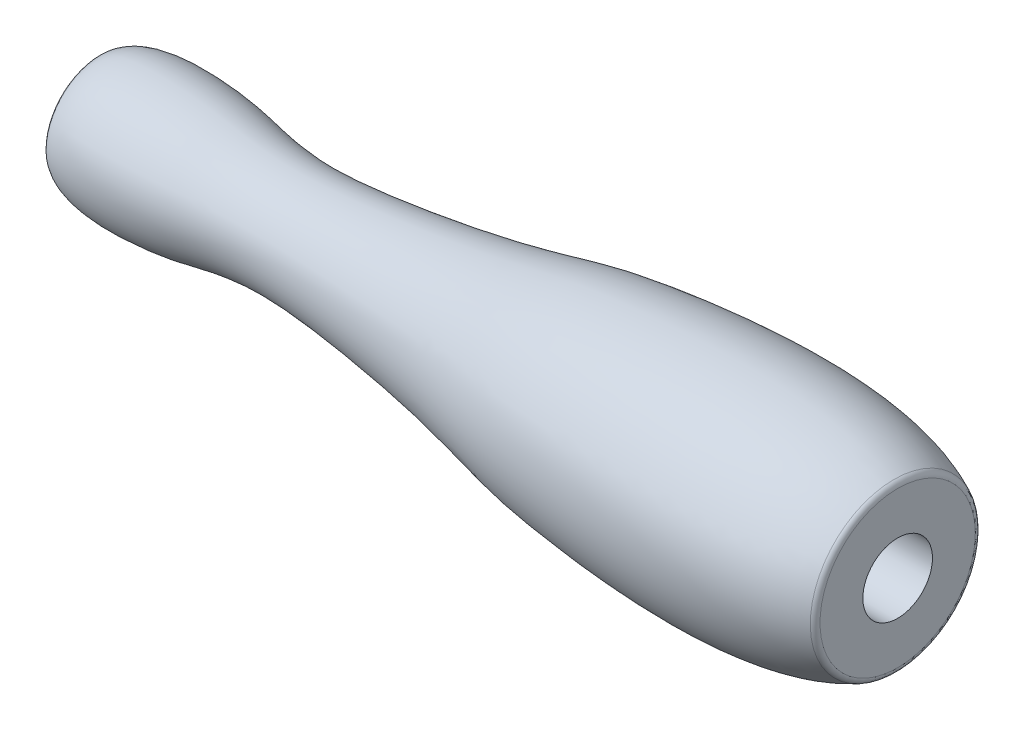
ISO-10303-21;
HEADER;
FILE_DESCRIPTION(('STEP AP214'),'2;1');
FILE_NAME('part.step','',(''),(''),'','','');
FILE_SCHEMA(('AUTOMOTIVE_DESIGN { 1 0 10303 214 1 1 1 1 }'));
ENDSEC;
DATA;
#1=APPLICATION_CONTEXT('core data for automotive mechanical design processes');
#2=APPLICATION_PROTOCOL_DEFINITION('international standard','automotive_design',2000,#1);
#3=PRODUCT_CONTEXT('',#1,'mechanical');
#4=PRODUCT('Part','Part','',(#3));
#5=PRODUCT_RELATED_PRODUCT_CATEGORY('part','',(#4));
#6=PRODUCT_DEFINITION_FORMATION('','',#4);
#7=PRODUCT_DEFINITION_CONTEXT('part definition',#1,'design');
#8=PRODUCT_DEFINITION('design','',#6,#7);
#9=PRODUCT_DEFINITION_SHAPE('','',#8);
#10=(LENGTH_UNIT() NAMED_UNIT(*) SI_UNIT(.MILLI.,.METRE.));
#11=(NAMED_UNIT(*) PLANE_ANGLE_UNIT() SI_UNIT($,.RADIAN.));
#12=(NAMED_UNIT(*) SI_UNIT($,.STERADIAN.) SOLID_ANGLE_UNIT());
#13=UNCERTAINTY_MEASURE_WITH_UNIT(LENGTH_MEASURE(1.E-05),#10,'distance_accuracy_value','');
#14=(GEOMETRIC_REPRESENTATION_CONTEXT(3) GLOBAL_UNCERTAINTY_ASSIGNED_CONTEXT((#13)) GLOBAL_UNIT_ASSIGNED_CONTEXT((#10,
#11,#12)) REPRESENTATION_CONTEXT('',''));
#15=CARTESIAN_POINT('',(0.,0.,0.));
#16=DIRECTION('',(0.,0.,1.));
#17=DIRECTION('',(1.,0.,0.));
#18=AXIS2_PLACEMENT_3D('',#15,#16,#17);
#19=CARTESIAN_POINT('',(0.,9.,0.));
#20=CARTESIAN_POINT('',(-6.95725517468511,16.2468035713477,0.));
#21=CARTESIAN_POINT('',(-24.9652155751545,17.8065846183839,0.));
#22=CARTESIAN_POINT('',(-55.7244856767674,13.9990260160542,0.));
#23=CARTESIAN_POINT('',(-66.583919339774,10.8381797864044,0.));
#24=CARTESIAN_POINT('',(-92.5066939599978,7.28758896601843,0.));
#25=CARTESIAN_POINT('',(-99.5023429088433,7.68432305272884,0.));
#26=CARTESIAN_POINT('',(-110.815290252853,9.98749412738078,0.));
#27=CARTESIAN_POINT('',(-122.149725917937,10.7106934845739,0.));
#28=CARTESIAN_POINT('',(-125.,7.99999999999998,0.));
#29=B_SPLINE_CURVE_WITH_KNOTS('',3,(#19,#20,#21,#22,#23,#24,#25,#26,#27,#28),.UNSPECIFIED.,.F.,
.F.,(4,1,1,1,1,1,1,4),(0.,0.461482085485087,0.525037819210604,0.635557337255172,
0.728128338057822,0.877474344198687,0.899865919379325,1.),.UNSPECIFIED.);
#30=CARTESIAN_POINT('',(0.,0.,0.));
#31=DIRECTION('',(1.,0.,0.));
#32=AXIS1_PLACEMENT('',#30,#31);
#33=SURFACE_OF_REVOLUTION('',#29,#32);
#34=CARTESIAN_POINT('',(-124.579747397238,0.,0.));
#35=DIRECTION('',(1.,0.,0.));
#36=DIRECTION('',(0.,1.,0.));
#37=AXIS2_PLACEMENT_3D('',#34,#35,#36);
#38=CIRCLE('',#37,8.34436980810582);
#39=CARTESIAN_POINT('',(-124.579747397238,8.3443698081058,0.));
#40=VERTEX_POINT('',#39);
#41=EDGE_CURVE('E47',#40,#40,#38,.T.);
#42=ORIENTED_EDGE('',*,*,#41,.T.);
#43=EDGE_LOOP('',(#42));
#44=FACE_BOUND('',#43,.T.);
#45=CARTESIAN_POINT('',(-5.09928358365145,0.,0.));
#46=DIRECTION('',(1.,0.,0.));
#47=DIRECTION('',(0.,1.,0.));
#48=AXIS2_PLACEMENT_3D('',#45,#46,#47);
#49=CIRCLE('',#48,12.6055927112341);
#50=CARTESIAN_POINT('',(-5.09928358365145,12.6055927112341,0.));
#51=VERTEX_POINT('',#50);
#52=EDGE_CURVE('E53',#51,#51,#49,.F.);
#53=ORIENTED_EDGE('',*,*,#52,.T.);
#54=EDGE_LOOP('',(#53));
#55=FACE_BOUND('',#54,.T.);
#56=ADVANCED_FACE('F34',(#44,#55),#33,.F.);
#57=CARTESIAN_POINT('',(-125.,0.,0.));
#58=DIRECTION('',(1.,0.,0.));
#59=DIRECTION('',(0.,1.,0.));
#60=AXIS2_PLACEMENT_3D('',#57,#58,#59);
#61=CYLINDRICAL_SURFACE('',#60,5.25);
#62=CARTESIAN_POINT('',(-125.,0.,0.));
#63=DIRECTION('',(1.,0.,0.));
#64=DIRECTION('',(0.,1.,0.));
#65=AXIS2_PLACEMENT_3D('',#62,#63,#64);
#66=CIRCLE('',#65,5.25);
#67=CARTESIAN_POINT('',(-125.,5.24999999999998,0.));
#68=VERTEX_POINT('',#67);
#69=EDGE_CURVE('E59',#68,#68,#66,.T.);
#70=ORIENTED_EDGE('',*,*,#69,.F.);
#71=EDGE_LOOP('',(#70));
#72=FACE_BOUND('',#71,.T.);
#73=CARTESIAN_POINT('',(-4.53718427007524,0.,0.));
#74=DIRECTION('',(1.,0.,0.));
#75=DIRECTION('',(0.,0.,-1.));
#76=AXIS2_PLACEMENT_3D('',#73,#74,#75);
#77=CIRCLE('',#76,5.25);
#78=CARTESIAN_POINT('',(-4.53718427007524,0.,-5.25));
#79=VERTEX_POINT('',#78);
#80=EDGE_CURVE('E60',#79,#79,#77,.F.);
#81=ORIENTED_EDGE('',*,*,#80,.F.);
#82=EDGE_LOOP('',(#81));
#83=FACE_BOUND('',#82,.T.);
#84=ADVANCED_FACE('F73',(#72,#83),#61,.F.);
#85=CARTESIAN_POINT('',(-125.,0.,0.));
#86=DIRECTION('',(-1.,0.,0.));
#87=DIRECTION('',(0.,-1.,0.));
#88=AXIS2_PLACEMENT_3D('',#85,#86,#87);
#89=PLANE('',#88);
#90=CARTESIAN_POINT('',(-125.,0.,0.));
#91=DIRECTION('',(-1.,0.,0.));
#92=DIRECTION('',(0.,-1.,0.));
#93=AXIS2_PLACEMENT_3D('',#90,#91,#92);
#94=CIRCLE('',#93,7.52957354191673);
#95=CARTESIAN_POINT('',(-125.,-7.52957354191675,0.));
#96=VERTEX_POINT('',#95);
#97=EDGE_CURVE('E42',#96,#96,#94,.T.);
#98=ORIENTED_EDGE('',*,*,#97,.T.);
#99=EDGE_LOOP('',(#98));
#100=FACE_BOUND('',#99,.T.);
#101=ORIENTED_EDGE('',*,*,#69,.T.);
#102=EDGE_LOOP('',(#101));
#103=FACE_BOUND('',#102,.T.);
#104=ADVANCED_FACE('F75',(#100,#103),#89,.T.);
#105=CARTESIAN_POINT('',(-4.53718427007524,20.,-25.0781879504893));
#106=DIRECTION('',(1.,0.,0.));
#107=DIRECTION('',(0.,0.,-1.));
#108=AXIS2_PLACEMENT_3D('',#105,#106,#107);
#109=PLANE('',#108);
#110=CARTESIAN_POINT('',(-4.53718427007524,0.,0.));
#111=DIRECTION('',(1.,0.,0.));
#112=DIRECTION('',(0.,0.,-1.));
#113=AXIS2_PLACEMENT_3D('',#110,#111,#112);
#114=CIRCLE('',#113,11.706569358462);
#115=CARTESIAN_POINT('',(-4.53718427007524,0.,-11.706569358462));
#116=VERTEX_POINT('',#115);
#117=EDGE_CURVE('E10',#116,#116,#114,.T.);
#118=ORIENTED_EDGE('',*,*,#117,.T.);
#119=EDGE_LOOP('',(#118));
#120=FACE_BOUND('',#119,.T.);
#121=ORIENTED_EDGE('',*,*,#80,.T.);
#122=EDGE_LOOP('',(#121));
#123=FACE_BOUND('',#122,.T.);
#124=ADVANCED_FACE('F79',(#120,#123),#109,.T.);
#125=CARTESIAN_POINT('',(-124.,0.,0.));
#126=DIRECTION('',(1.,0.,0.));
#127=DIRECTION('',(0.,1.,0.));
#128=AXIS2_PLACEMENT_3D('',#125,#126,#127);
#129=TOROIDAL_SURFACE('',#128,7.52957354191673,1.);
#130=ORIENTED_EDGE('',*,*,#97,.F.);
#131=EDGE_LOOP('',(#130));
#132=FACE_BOUND('',#131,.T.);
#133=ORIENTED_EDGE('',*,*,#41,.F.);
#134=EDGE_LOOP('',(#133));
#135=FACE_BOUND('',#134,.T.);
#136=ADVANCED_FACE('F77',(#132,#135),#129,.T.);
#137=CARTESIAN_POINT('',(-5.53718427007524,0.,0.));
#138=DIRECTION('',(1.,0.,0.));
#139=DIRECTION('',(0.,1.,0.));
#140=AXIS2_PLACEMENT_3D('',#137,#138,#139);
#141=TOROIDAL_SURFACE('',#140,11.706569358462,1.);
#142=ORIENTED_EDGE('',*,*,#117,.F.);
#143=EDGE_LOOP('',(#142));
#144=FACE_BOUND('',#143,.T.);
#145=ORIENTED_EDGE('',*,*,#52,.F.);
#146=EDGE_LOOP('',(#145));
#147=FACE_BOUND('',#146,.T.);
#148=ADVANCED_FACE('F36',(#144,#147),#141,.T.);
#149=CLOSED_SHELL('',(#56,#84,#104,#124,#136,#148));
#150=MANIFOLD_SOLID_BREP('B2',#149);
#151=ADVANCED_BREP_SHAPE_REPRESENTATION('',(#18,#150),#14);
#152=SHAPE_DEFINITION_REPRESENTATION(#9,#151);
ENDSEC;
END-ISO-10303-21;
